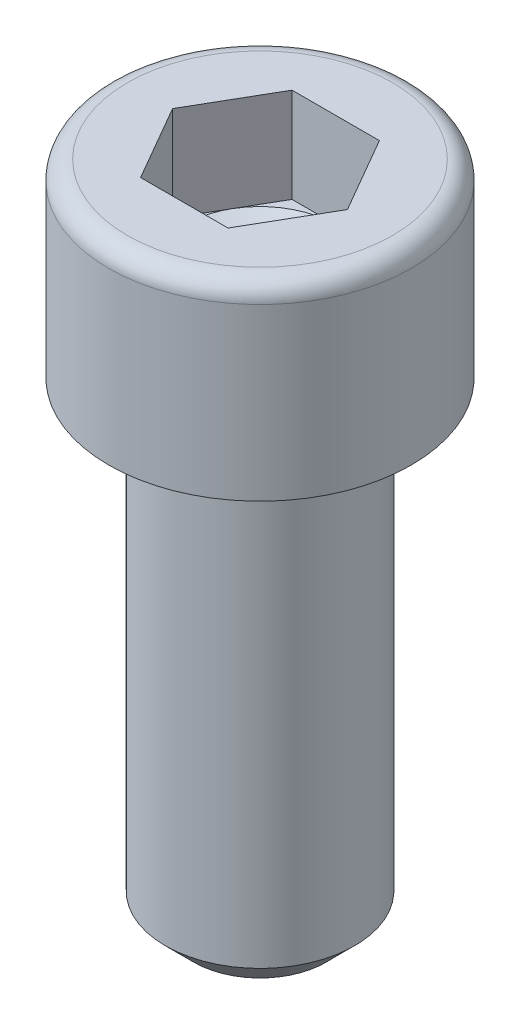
from build123d import *

# Parameters (mm, degrees)
TIGE_START              = -25
ESQUISSE1_R             = 5
TIGE_DEPTH              = 25
CHANFREIN_D_ENTR_E_SIZE = 1.5
HEXAGONE_DEPTH          = 5


with BuildPart() as part:
    # Esquisse1 → Tige (new body)
    with BuildSketch(Plane(origin=(0, 0, 0), x_dir=(1, 0, 0), z_dir=(0, 1, 0)).offset(TIGE_START)):
        with Locations(Location((0, 0, 0), (0, 0, 270))):
            Circle(ESQUISSE1_R)
    extrude(amount=TIGE_DEPTH)

    # Chanfrein d_entr_e
    chanfrein_d_entr_e_edges = [part.edges().sort_by_distance(p)[0] for p in [
        (0, -25, -5),
    ]]
    chamfer(chanfrein_d_entr_e_edges, length=CHANFREIN_D_ENTR_E_SIZE)

    # Esquisse2 → T_te (revolve)
    with BuildSketch(Plane.XY, mode=Mode.PRIVATE) as t_te_sk:
        with BuildLine():
            Line((4, 10), (4, 5))
            Line((4, 5), (0, 2.690598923))
            Line((0, 2.690598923), (0, 0))
            Line((0, 0), (8, 0))
            Line((8, 0), (8, 9))
            ThreePointArc((8, 9), (7.707106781, 9.707106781), (7, 10))
            Line((7, 10), (4, 10))
        make_face()
    revolve(t_te_sk.sketch.rotate(Axis((0, 10, 0), (0, -1, 0)), 180), axis=Axis((0, 10, 0), (0, -1, 0)))

    # Esquisse3 → Hexagone (cut)
    with BuildSketch(Plane(origin=(0, 10, -3), x_dir=(1, 0, 0), z_dir=(0, -1, 0))):
        Polygon((2.309401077, 7), (-2.309401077, 7), (-4.618802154, 3), (-2.309401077, -1), (2.309401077, -1), (4.618802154, 3), align=None)
    extrude(amount=HEXAGONE_DEPTH, mode=Mode.SUBTRACT)


solid = part.part
